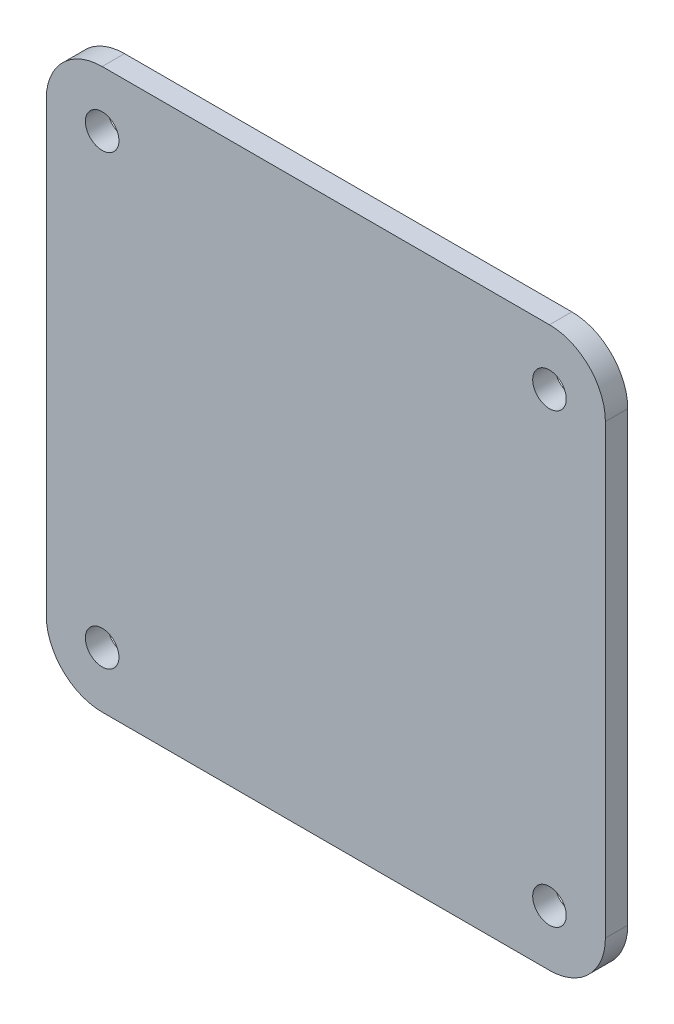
ISO-10303-21;
HEADER;
FILE_DESCRIPTION(('STEP AP214'),'2;1');
FILE_NAME('part.step','',(''),(''),'','','');
FILE_SCHEMA(('AUTOMOTIVE_DESIGN { 1 0 10303 214 1 1 1 1 }'));
ENDSEC;
DATA;
#1=APPLICATION_CONTEXT('core data for automotive mechanical design processes');
#2=APPLICATION_PROTOCOL_DEFINITION('international standard','automotive_design',2000,#1);
#3=PRODUCT_CONTEXT('',#1,'mechanical');
#4=PRODUCT('Part','Part','',(#3));
#5=PRODUCT_RELATED_PRODUCT_CATEGORY('part','',(#4));
#6=PRODUCT_DEFINITION_FORMATION('','',#4);
#7=PRODUCT_DEFINITION_CONTEXT('part definition',#1,'design');
#8=PRODUCT_DEFINITION('design','',#6,#7);
#9=PRODUCT_DEFINITION_SHAPE('','',#8);
#10=(LENGTH_UNIT() NAMED_UNIT(*) SI_UNIT(.MILLI.,.METRE.));
#11=(NAMED_UNIT(*) PLANE_ANGLE_UNIT() SI_UNIT($,.RADIAN.));
#12=(NAMED_UNIT(*) SI_UNIT($,.STERADIAN.) SOLID_ANGLE_UNIT());
#13=UNCERTAINTY_MEASURE_WITH_UNIT(LENGTH_MEASURE(1.E-05),#10,'distance_accuracy_value','');
#14=(GEOMETRIC_REPRESENTATION_CONTEXT(3) GLOBAL_UNCERTAINTY_ASSIGNED_CONTEXT((#13)) GLOBAL_UNIT_ASSIGNED_CONTEXT((#10,
#11,#12)) REPRESENTATION_CONTEXT('',''));
#15=CARTESIAN_POINT('',(0.,0.,0.));
#16=DIRECTION('',(0.,0.,1.));
#17=DIRECTION('',(1.,0.,0.));
#18=AXIS2_PLACEMENT_3D('',#15,#16,#17);
#19=CARTESIAN_POINT('',(0.,0.,4.));
#20=DIRECTION('',(-1.,0.,0.));
#21=DIRECTION('',(0.,-1.,0.));
#22=AXIS2_PLACEMENT_3D('',#19,#20,#21);
#23=PLANE('',#22);
#24=DIRECTION('',(0.,1.,0.));
#25=VECTOR('',#24,1.);
#26=CARTESIAN_POINT('',(0.,0.,4.));
#27=LINE('',#26,#25);
#28=CARTESIAN_POINT('',(0.,10.,4.));
#29=VERTEX_POINT('',#28);
#30=CARTESIAN_POINT('',(0.,90.,4.));
#31=VERTEX_POINT('',#30);
#32=EDGE_CURVE('E128',#29,#31,#27,.T.);
#33=ORIENTED_EDGE('',*,*,#32,.F.);
#34=DIRECTION('',(0.,0.,-1.));
#35=VECTOR('',#34,1.);
#36=CARTESIAN_POINT('',(0.,10.,4.));
#37=LINE('',#36,#35);
#38=CARTESIAN_POINT('',(0.,10.,0.));
#39=VERTEX_POINT('',#38);
#40=EDGE_CURVE('E154',#29,#39,#37,.T.);
#41=ORIENTED_EDGE('',*,*,#40,.T.);
#42=DIRECTION('',(0.,1.,0.));
#43=VECTOR('',#42,1.);
#44=CARTESIAN_POINT('',(0.,0.,0.));
#45=LINE('',#44,#43);
#46=CARTESIAN_POINT('',(0.,90.,0.));
#47=VERTEX_POINT('',#46);
#48=EDGE_CURVE('E162',#39,#47,#45,.T.);
#49=ORIENTED_EDGE('',*,*,#48,.T.);
#50=DIRECTION('',(0.,0.,-1.));
#51=VECTOR('',#50,1.);
#52=CARTESIAN_POINT('',(0.,90.,4.));
#53=LINE('',#52,#51);
#54=EDGE_CURVE('E152',#47,#31,#53,.F.);
#55=ORIENTED_EDGE('',*,*,#54,.T.);
#56=EDGE_LOOP('',(#33,#41,#49,#55));
#57=FACE_BOUND('',#56,.T.);
#58=ADVANCED_FACE('F37',(#57),#23,.F.);
#59=CARTESIAN_POINT('',(0.,100.,4.));
#60=DIRECTION('',(0.,-1.,0.));
#61=DIRECTION('',(1.,0.,0.));
#62=AXIS2_PLACEMENT_3D('',#59,#60,#61);
#63=PLANE('',#62);
#64=DIRECTION('',(-1.,0.,0.));
#65=VECTOR('',#64,1.);
#66=CARTESIAN_POINT('',(0.,100.,0.));
#67=LINE('',#66,#65);
#68=CARTESIAN_POINT('',(-10.,100.,0.));
#69=VERTEX_POINT('',#68);
#70=CARTESIAN_POINT('',(-90.,100.,0.));
#71=VERTEX_POINT('',#70);
#72=EDGE_CURVE('E133',#69,#71,#67,.T.);
#73=ORIENTED_EDGE('',*,*,#72,.T.);
#74=DIRECTION('',(0.,0.,-1.));
#75=VECTOR('',#74,1.);
#76=CARTESIAN_POINT('',(-90.,100.,4.));
#77=LINE('',#76,#75);
#78=CARTESIAN_POINT('',(-90.,100.,4.));
#79=VERTEX_POINT('',#78);
#80=EDGE_CURVE('E11',#71,#79,#77,.F.);
#81=ORIENTED_EDGE('',*,*,#80,.T.);
#82=DIRECTION('',(-1.,0.,0.));
#83=VECTOR('',#82,1.);
#84=CARTESIAN_POINT('',(0.,100.,4.));
#85=LINE('',#84,#83);
#86=CARTESIAN_POINT('',(-10.,100.,4.));
#87=VERTEX_POINT('',#86);
#88=EDGE_CURVE('E131',#87,#79,#85,.T.);
#89=ORIENTED_EDGE('',*,*,#88,.F.);
#90=DIRECTION('',(0.,0.,-1.));
#91=VECTOR('',#90,1.);
#92=CARTESIAN_POINT('',(-10.,100.,4.));
#93=LINE('',#92,#91);
#94=EDGE_CURVE('E45',#87,#69,#93,.T.);
#95=ORIENTED_EDGE('',*,*,#94,.T.);
#96=EDGE_LOOP('',(#73,#81,#89,#95));
#97=FACE_BOUND('',#96,.T.);
#98=ADVANCED_FACE('F159',(#97),#63,.F.);
#99=CARTESIAN_POINT('',(-100.,0.,4.));
#100=DIRECTION('',(1.,0.,0.));
#101=DIRECTION('',(0.,0.,-1.));
#102=AXIS2_PLACEMENT_3D('',#99,#100,#101);
#103=PLANE('',#102);
#104=DIRECTION('',(0.,-1.,0.));
#105=VECTOR('',#104,1.);
#106=CARTESIAN_POINT('',(-100.,0.,0.));
#107=LINE('',#106,#105);
#108=CARTESIAN_POINT('',(-100.,90.,0.));
#109=VERTEX_POINT('',#108);
#110=CARTESIAN_POINT('',(-100.,9.99999999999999,0.));
#111=VERTEX_POINT('',#110);
#112=EDGE_CURVE('E129',#109,#111,#107,.T.);
#113=ORIENTED_EDGE('',*,*,#112,.T.);
#114=DIRECTION('',(0.,0.,-1.));
#115=VECTOR('',#114,1.);
#116=CARTESIAN_POINT('',(-100.,9.99999999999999,4.));
#117=LINE('',#116,#115);
#118=CARTESIAN_POINT('',(-100.,9.99999999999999,4.));
#119=VERTEX_POINT('',#118);
#120=EDGE_CURVE('E107',#111,#119,#117,.F.);
#121=ORIENTED_EDGE('',*,*,#120,.T.);
#122=DIRECTION('',(0.,-1.,0.));
#123=VECTOR('',#122,1.);
#124=CARTESIAN_POINT('',(-100.,0.,4.));
#125=LINE('',#124,#123);
#126=CARTESIAN_POINT('',(-100.,90.,4.));
#127=VERTEX_POINT('',#126);
#128=EDGE_CURVE('E167',#127,#119,#125,.T.);
#129=ORIENTED_EDGE('',*,*,#128,.F.);
#130=DIRECTION('',(0.,0.,-1.));
#131=VECTOR('',#130,1.);
#132=CARTESIAN_POINT('',(-100.,90.,4.));
#133=LINE('',#132,#131);
#134=EDGE_CURVE('E112',#127,#109,#133,.T.);
#135=ORIENTED_EDGE('',*,*,#134,.T.);
#136=EDGE_LOOP('',(#113,#121,#129,#135));
#137=FACE_BOUND('',#136,.T.);
#138=ADVANCED_FACE('F217',(#137),#103,.F.);
#139=CARTESIAN_POINT('',(0.,0.,4.));
#140=DIRECTION('',(0.,1.,0.));
#141=DIRECTION('',(-1.,0.,0.));
#142=AXIS2_PLACEMENT_3D('',#139,#140,#141);
#143=PLANE('',#142);
#144=DIRECTION('',(1.,0.,0.));
#145=VECTOR('',#144,1.);
#146=CARTESIAN_POINT('',(0.,0.,4.));
#147=LINE('',#146,#145);
#148=CARTESIAN_POINT('',(-90.,0.,4.));
#149=VERTEX_POINT('',#148);
#150=CARTESIAN_POINT('',(-10.,0.,4.));
#151=VERTEX_POINT('',#150);
#152=EDGE_CURVE('E122',#149,#151,#147,.T.);
#153=ORIENTED_EDGE('',*,*,#152,.F.);
#154=DIRECTION('',(0.,0.,-1.));
#155=VECTOR('',#154,1.);
#156=CARTESIAN_POINT('',(-90.,0.,4.));
#157=LINE('',#156,#155);
#158=CARTESIAN_POINT('',(-90.,0.,0.));
#159=VERTEX_POINT('',#158);
#160=EDGE_CURVE('E106',#149,#159,#157,.T.);
#161=ORIENTED_EDGE('',*,*,#160,.T.);
#162=DIRECTION('',(1.,0.,0.));
#163=VECTOR('',#162,1.);
#164=CARTESIAN_POINT('',(0.,0.,0.));
#165=LINE('',#164,#163);
#166=CARTESIAN_POINT('',(-10.,0.,0.));
#167=VERTEX_POINT('',#166);
#168=EDGE_CURVE('E119',#159,#167,#165,.T.);
#169=ORIENTED_EDGE('',*,*,#168,.T.);
#170=DIRECTION('',(0.,0.,-1.));
#171=VECTOR('',#170,1.);
#172=CARTESIAN_POINT('',(-10.,0.,4.));
#173=LINE('',#172,#171);
#174=EDGE_CURVE('E124',#167,#151,#173,.F.);
#175=ORIENTED_EDGE('',*,*,#174,.T.);
#176=EDGE_LOOP('',(#153,#161,#169,#175));
#177=FACE_BOUND('',#176,.T.);
#178=ADVANCED_FACE('F118',(#177),#143,.F.);
#179=CARTESIAN_POINT('',(0.,0.,4.));
#180=DIRECTION('',(0.,0.,1.));
#181=DIRECTION('',(1.,0.,0.));
#182=AXIS2_PLACEMENT_3D('',#179,#180,#181);
#183=PLANE('',#182);
#184=CARTESIAN_POINT('',(-90.,90.,4.));
#185=DIRECTION('',(0.,0.,1.));
#186=DIRECTION('',(1.,0.,0.));
#187=AXIS2_PLACEMENT_3D('',#184,#185,#186);
#188=CIRCLE('',#187,3.00000000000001);
#189=CARTESIAN_POINT('',(-87.,90.,4.));
#190=VERTEX_POINT('',#189);
#191=EDGE_CURVE('E189',#190,#190,#188,.T.);
#192=ORIENTED_EDGE('',*,*,#191,.F.);
#193=EDGE_LOOP('',(#192));
#194=FACE_BOUND('',#193,.T.);
#195=CARTESIAN_POINT('',(-90.,9.99999999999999,4.));
#196=DIRECTION('',(0.,0.,1.));
#197=DIRECTION('',(1.,0.,0.));
#198=AXIS2_PLACEMENT_3D('',#195,#196,#197);
#199=CIRCLE('',#198,3.00000000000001);
#200=CARTESIAN_POINT('',(-87.,9.99999999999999,4.));
#201=VERTEX_POINT('',#200);
#202=EDGE_CURVE('E183',#201,#201,#199,.T.);
#203=ORIENTED_EDGE('',*,*,#202,.F.);
#204=EDGE_LOOP('',(#203));
#205=FACE_BOUND('',#204,.T.);
#206=CARTESIAN_POINT('',(-9.99999999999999,90.,4.));
#207=DIRECTION('',(0.,0.,1.));
#208=DIRECTION('',(1.,0.,0.));
#209=AXIS2_PLACEMENT_3D('',#206,#207,#208);
#210=CIRCLE('',#209,3.);
#211=CARTESIAN_POINT('',(-6.99999999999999,90.,4.));
#212=VERTEX_POINT('',#211);
#213=EDGE_CURVE('E177',#212,#212,#210,.T.);
#214=ORIENTED_EDGE('',*,*,#213,.F.);
#215=EDGE_LOOP('',(#214));
#216=FACE_BOUND('',#215,.T.);
#217=CARTESIAN_POINT('',(-9.99999999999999,9.99999999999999,4.));
#218=DIRECTION('',(0.,0.,1.));
#219=DIRECTION('',(1.,0.,0.));
#220=AXIS2_PLACEMENT_3D('',#217,#218,#219);
#221=CIRCLE('',#220,3.);
#222=CARTESIAN_POINT('',(-6.99999999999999,9.99999999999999,4.));
#223=VERTEX_POINT('',#222);
#224=EDGE_CURVE('E171',#223,#223,#221,.T.);
#225=ORIENTED_EDGE('',*,*,#224,.F.);
#226=EDGE_LOOP('',(#225));
#227=FACE_BOUND('',#226,.T.);
#228=ORIENTED_EDGE('',*,*,#128,.T.);
#229=CARTESIAN_POINT('',(-90.,9.99999999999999,4.));
#230=DIRECTION('',(0.,0.,1.));
#231=DIRECTION('',(1.,0.,0.));
#232=AXIS2_PLACEMENT_3D('',#229,#230,#231);
#233=CIRCLE('',#232,10.);
#234=EDGE_CURVE('E150',#119,#149,#233,.T.);
#235=ORIENTED_EDGE('',*,*,#234,.T.);
#236=ORIENTED_EDGE('',*,*,#152,.T.);
#237=CARTESIAN_POINT('',(-10.,10.,4.));
#238=DIRECTION('',(0.,0.,1.));
#239=DIRECTION('',(1.,0.,0.));
#240=AXIS2_PLACEMENT_3D('',#237,#238,#239);
#241=CIRCLE('',#240,10.);
#242=EDGE_CURVE('E148',#151,#29,#241,.T.);
#243=ORIENTED_EDGE('',*,*,#242,.T.);
#244=ORIENTED_EDGE('',*,*,#32,.T.);
#245=CARTESIAN_POINT('',(-10.,90.,4.));
#246=DIRECTION('',(0.,0.,1.));
#247=DIRECTION('',(1.,0.,0.));
#248=AXIS2_PLACEMENT_3D('',#245,#246,#247);
#249=CIRCLE('',#248,10.);
#250=EDGE_CURVE('E57',#31,#87,#249,.T.);
#251=ORIENTED_EDGE('',*,*,#250,.T.);
#252=ORIENTED_EDGE('',*,*,#88,.T.);
#253=CARTESIAN_POINT('',(-90.,90.,4.));
#254=DIRECTION('',(0.,0.,1.));
#255=DIRECTION('',(1.,0.,0.));
#256=AXIS2_PLACEMENT_3D('',#253,#254,#255);
#257=CIRCLE('',#256,10.);
#258=EDGE_CURVE('E146',#79,#127,#257,.T.);
#259=ORIENTED_EDGE('',*,*,#258,.T.);
#260=EDGE_LOOP('',(#228,#235,#236,#243,#244,#251,#252,#259));
#261=FACE_BOUND('',#260,.T.);
#262=ADVANCED_FACE('F204',(#194,#205,#216,#227,#261),#183,.T.);
#263=CARTESIAN_POINT('',(0.,0.,0.));
#264=DIRECTION('',(0.,0.,1.));
#265=DIRECTION('',(1.,0.,0.));
#266=AXIS2_PLACEMENT_3D('',#263,#264,#265);
#267=PLANE('',#266);
#268=CARTESIAN_POINT('',(-90.,90.,0.));
#269=DIRECTION('',(0.,0.,1.));
#270=DIRECTION('',(1.,0.,0.));
#271=AXIS2_PLACEMENT_3D('',#268,#269,#270);
#272=CIRCLE('',#271,3.00000000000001);
#273=CARTESIAN_POINT('',(-87.,90.,0.));
#274=VERTEX_POINT('',#273);
#275=EDGE_CURVE('E186',#274,#274,#272,.T.);
#276=ORIENTED_EDGE('',*,*,#275,.T.);
#277=EDGE_LOOP('',(#276));
#278=FACE_BOUND('',#277,.T.);
#279=CARTESIAN_POINT('',(-90.,9.99999999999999,0.));
#280=DIRECTION('',(0.,0.,1.));
#281=DIRECTION('',(1.,0.,0.));
#282=AXIS2_PLACEMENT_3D('',#279,#280,#281);
#283=CIRCLE('',#282,3.00000000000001);
#284=CARTESIAN_POINT('',(-87.,9.99999999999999,0.));
#285=VERTEX_POINT('',#284);
#286=EDGE_CURVE('E180',#285,#285,#283,.T.);
#287=ORIENTED_EDGE('',*,*,#286,.T.);
#288=EDGE_LOOP('',(#287));
#289=FACE_BOUND('',#288,.T.);
#290=CARTESIAN_POINT('',(-9.99999999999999,90.,0.));
#291=DIRECTION('',(0.,0.,1.));
#292=DIRECTION('',(1.,0.,0.));
#293=AXIS2_PLACEMENT_3D('',#290,#291,#292);
#294=CIRCLE('',#293,3.);
#295=CARTESIAN_POINT('',(-6.99999999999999,90.,0.));
#296=VERTEX_POINT('',#295);
#297=EDGE_CURVE('E174',#296,#296,#294,.T.);
#298=ORIENTED_EDGE('',*,*,#297,.T.);
#299=EDGE_LOOP('',(#298));
#300=FACE_BOUND('',#299,.T.);
#301=CARTESIAN_POINT('',(-9.99999999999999,9.99999999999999,0.));
#302=DIRECTION('',(0.,0.,1.));
#303=DIRECTION('',(1.,0.,0.));
#304=AXIS2_PLACEMENT_3D('',#301,#302,#303);
#305=CIRCLE('',#304,3.);
#306=CARTESIAN_POINT('',(-6.99999999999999,9.99999999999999,0.));
#307=VERTEX_POINT('',#306);
#308=EDGE_CURVE('E163',#307,#307,#305,.T.);
#309=ORIENTED_EDGE('',*,*,#308,.T.);
#310=EDGE_LOOP('',(#309));
#311=FACE_BOUND('',#310,.T.);
#312=ORIENTED_EDGE('',*,*,#168,.F.);
#313=CARTESIAN_POINT('',(-90.,9.99999999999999,0.));
#314=DIRECTION('',(0.,0.,1.));
#315=DIRECTION('',(1.,0.,0.));
#316=AXIS2_PLACEMENT_3D('',#313,#314,#315);
#317=CIRCLE('',#316,10.);
#318=EDGE_CURVE('E102',#159,#111,#317,.F.);
#319=ORIENTED_EDGE('',*,*,#318,.T.);
#320=ORIENTED_EDGE('',*,*,#112,.F.);
#321=CARTESIAN_POINT('',(-90.,90.,0.));
#322=DIRECTION('',(0.,0.,1.));
#323=DIRECTION('',(1.,0.,0.));
#324=AXIS2_PLACEMENT_3D('',#321,#322,#323);
#325=CIRCLE('',#324,10.);
#326=EDGE_CURVE('E139',#109,#71,#325,.F.);
#327=ORIENTED_EDGE('',*,*,#326,.T.);
#328=ORIENTED_EDGE('',*,*,#72,.F.);
#329=CARTESIAN_POINT('',(-10.,90.,0.));
#330=DIRECTION('',(0.,0.,1.));
#331=DIRECTION('',(1.,0.,0.));
#332=AXIS2_PLACEMENT_3D('',#329,#330,#331);
#333=CIRCLE('',#332,10.);
#334=EDGE_CURVE('E123',#69,#47,#333,.F.);
#335=ORIENTED_EDGE('',*,*,#334,.T.);
#336=ORIENTED_EDGE('',*,*,#48,.F.);
#337=CARTESIAN_POINT('',(-10.,10.,0.));
#338=DIRECTION('',(0.,0.,1.));
#339=DIRECTION('',(1.,0.,0.));
#340=AXIS2_PLACEMENT_3D('',#337,#338,#339);
#341=CIRCLE('',#340,10.);
#342=EDGE_CURVE('E113',#39,#167,#341,.F.);
#343=ORIENTED_EDGE('',*,*,#342,.T.);
#344=EDGE_LOOP('',(#312,#319,#320,#327,#328,#335,#336,#343));
#345=FACE_BOUND('',#344,.T.);
#346=ADVANCED_FACE('F126',(#278,#289,#300,#311,#345),#267,.F.);
#347=CARTESIAN_POINT('',(-90.,9.99999999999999,4.));
#348=DIRECTION('',(0.,0.,-1.));
#349=DIRECTION('',(-1.,0.,0.));
#350=AXIS2_PLACEMENT_3D('',#347,#348,#349);
#351=CYLINDRICAL_SURFACE('',#350,10.);
#352=ORIENTED_EDGE('',*,*,#234,.F.);
#353=ORIENTED_EDGE('',*,*,#120,.F.);
#354=ORIENTED_EDGE('',*,*,#318,.F.);
#355=ORIENTED_EDGE('',*,*,#160,.F.);
#356=EDGE_LOOP('',(#352,#353,#354,#355));
#357=FACE_BOUND('',#356,.T.);
#358=ADVANCED_FACE('F105',(#357),#351,.T.);
#359=CARTESIAN_POINT('',(-10.,10.,4.));
#360=DIRECTION('',(0.,0.,-1.));
#361=DIRECTION('',(-1.,0.,0.));
#362=AXIS2_PLACEMENT_3D('',#359,#360,#361);
#363=CYLINDRICAL_SURFACE('',#362,10.);
#364=ORIENTED_EDGE('',*,*,#242,.F.);
#365=ORIENTED_EDGE('',*,*,#174,.F.);
#366=ORIENTED_EDGE('',*,*,#342,.F.);
#367=ORIENTED_EDGE('',*,*,#40,.F.);
#368=EDGE_LOOP('',(#364,#365,#366,#367));
#369=FACE_BOUND('',#368,.T.);
#370=ADVANCED_FACE('F221',(#369),#363,.T.);
#371=CARTESIAN_POINT('',(-90.,90.,4.));
#372=DIRECTION('',(0.,0.,-1.));
#373=DIRECTION('',(-1.,0.,0.));
#374=AXIS2_PLACEMENT_3D('',#371,#372,#373);
#375=CYLINDRICAL_SURFACE('',#374,10.);
#376=ORIENTED_EDGE('',*,*,#258,.F.);
#377=ORIENTED_EDGE('',*,*,#80,.F.);
#378=ORIENTED_EDGE('',*,*,#326,.F.);
#379=ORIENTED_EDGE('',*,*,#134,.F.);
#380=EDGE_LOOP('',(#376,#377,#378,#379));
#381=FACE_BOUND('',#380,.T.);
#382=ADVANCED_FACE('F219',(#381),#375,.T.);
#383=CARTESIAN_POINT('',(-10.,90.,4.));
#384=DIRECTION('',(0.,0.,-1.));
#385=DIRECTION('',(-1.,0.,0.));
#386=AXIS2_PLACEMENT_3D('',#383,#384,#385);
#387=CYLINDRICAL_SURFACE('',#386,10.);
#388=ORIENTED_EDGE('',*,*,#250,.F.);
#389=ORIENTED_EDGE('',*,*,#54,.F.);
#390=ORIENTED_EDGE('',*,*,#334,.F.);
#391=ORIENTED_EDGE('',*,*,#94,.F.);
#392=EDGE_LOOP('',(#388,#389,#390,#391));
#393=FACE_BOUND('',#392,.T.);
#394=ADVANCED_FACE('F39',(#393),#387,.T.);
#395=CARTESIAN_POINT('',(-9.99999999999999,9.99999999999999,0.));
#396=DIRECTION('',(0.,0.,1.));
#397=DIRECTION('',(1.,0.,0.));
#398=AXIS2_PLACEMENT_3D('',#395,#396,#397);
#399=CYLINDRICAL_SURFACE('',#398,3.);
#400=ORIENTED_EDGE('',*,*,#308,.F.);
#401=EDGE_LOOP('',(#400));
#402=FACE_BOUND('',#401,.T.);
#403=ORIENTED_EDGE('',*,*,#224,.T.);
#404=EDGE_LOOP('',(#403));
#405=FACE_BOUND('',#404,.T.);
#406=ADVANCED_FACE('F226',(#402,#405),#399,.F.);
#407=CARTESIAN_POINT('',(-9.99999999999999,90.,0.));
#408=DIRECTION('',(0.,0.,1.));
#409=DIRECTION('',(1.,0.,0.));
#410=AXIS2_PLACEMENT_3D('',#407,#408,#409);
#411=CYLINDRICAL_SURFACE('',#410,3.);
#412=ORIENTED_EDGE('',*,*,#297,.F.);
#413=EDGE_LOOP('',(#412));
#414=FACE_BOUND('',#413,.T.);
#415=ORIENTED_EDGE('',*,*,#213,.T.);
#416=EDGE_LOOP('',(#415));
#417=FACE_BOUND('',#416,.T.);
#418=ADVANCED_FACE('F279',(#414,#417),#411,.F.);
#419=CARTESIAN_POINT('',(-90.,9.99999999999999,0.));
#420=DIRECTION('',(0.,0.,1.));
#421=DIRECTION('',(1.,0.,0.));
#422=AXIS2_PLACEMENT_3D('',#419,#420,#421);
#423=CYLINDRICAL_SURFACE('',#422,3.00000000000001);
#424=ORIENTED_EDGE('',*,*,#286,.F.);
#425=EDGE_LOOP('',(#424));
#426=FACE_BOUND('',#425,.T.);
#427=ORIENTED_EDGE('',*,*,#202,.T.);
#428=EDGE_LOOP('',(#427));
#429=FACE_BOUND('',#428,.T.);
#430=ADVANCED_FACE('F200',(#426,#429),#423,.F.);
#431=CARTESIAN_POINT('',(-90.,90.,0.));
#432=DIRECTION('',(0.,0.,1.));
#433=DIRECTION('',(1.,0.,0.));
#434=AXIS2_PLACEMENT_3D('',#431,#432,#433);
#435=CYLINDRICAL_SURFACE('',#434,3.00000000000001);
#436=ORIENTED_EDGE('',*,*,#275,.F.);
#437=EDGE_LOOP('',(#436));
#438=FACE_BOUND('',#437,.T.);
#439=ORIENTED_EDGE('',*,*,#191,.T.);
#440=EDGE_LOOP('',(#439));
#441=FACE_BOUND('',#440,.T.);
#442=ADVANCED_FACE('F197',(#438,#441),#435,.F.);
#443=CLOSED_SHELL('',(#58,#98,#138,#178,#262,#346,#358,#370,#382,#394,#406,#418,#430,#442));
#444=MANIFOLD_SOLID_BREP('B2',#443);
#445=ADVANCED_BREP_SHAPE_REPRESENTATION('',(#18,#444),#14);
#446=SHAPE_DEFINITION_REPRESENTATION(#9,#445);
ENDSEC;
END-ISO-10303-21;
